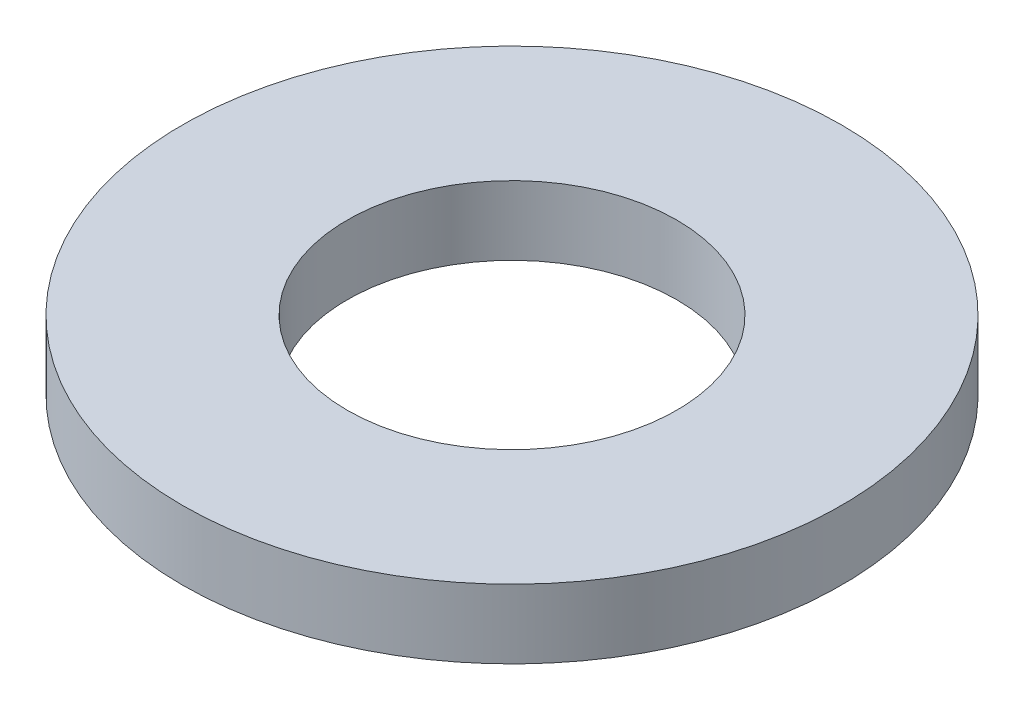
from build123d import *

# Parameters (mm, degrees)
SKETCH1_R           = 10.5
BOSS_EXTRUDE1_DEPTH = 2.2
SKETCH5_R           = 5.25
CUT_EXTRUDE1_DEPTH  = 16.011329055


with BuildPart() as part:
    # Sketch1 → Boss-Extrude1 (new body)
    with BuildSketch(Plane(origin=(0, 0, 0), x_dir=(1, 0, 0), z_dir=(0, 1, 0))):
        with Locations(Location((0, 0, 0), (0, 0, 270))):
            Circle(SKETCH1_R)
    extrude(amount=BOSS_EXTRUDE1_DEPTH)

    # Sketch5 → Cut-Extrude1 (cut, through all)
    with BuildSketch(Plane(origin=(0, 2.2, 0), x_dir=(-1, 0, 0), z_dir=(0, 1, 0))):
        with Locations(Location((0, 0, 0), (0, 0, 90))):
            Circle(SKETCH5_R)
    extrude(amount=-CUT_EXTRUDE1_DEPTH, mode=Mode.SUBTRACT)


solid = part.part
